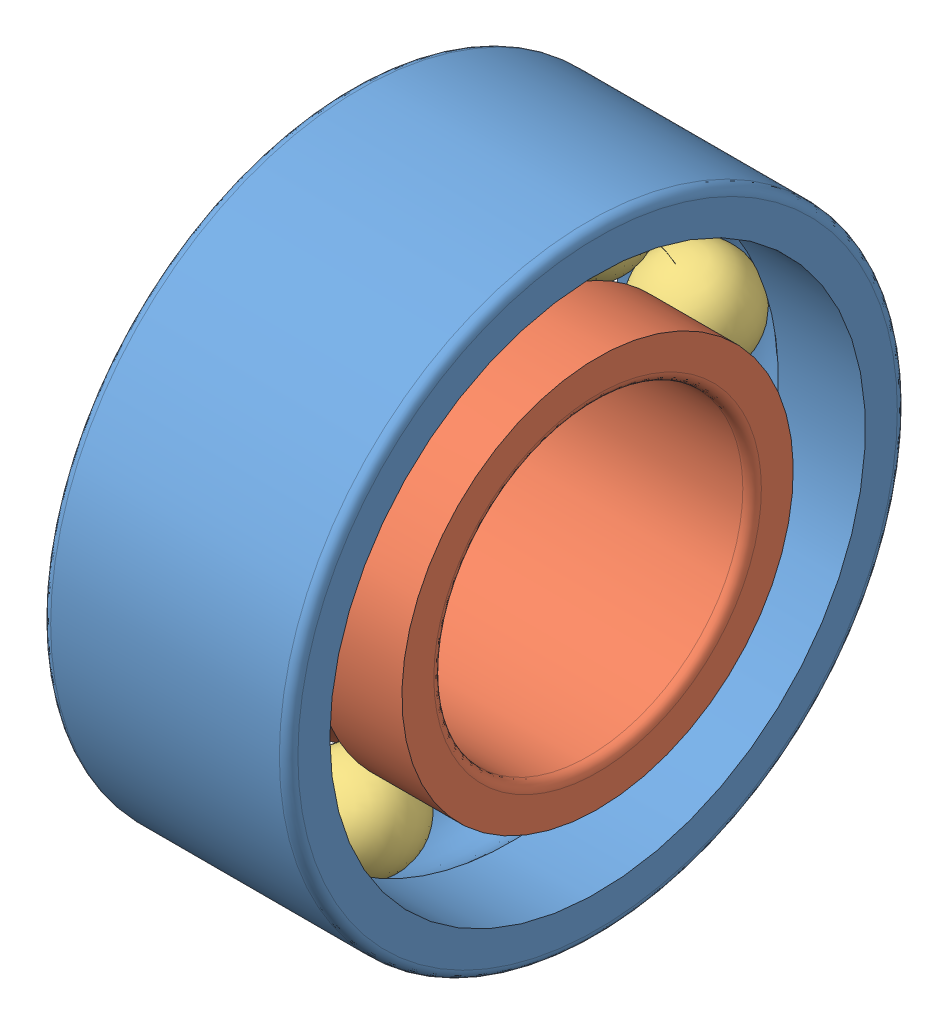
SolidWorks assembly MR105 ZZ.SLDASM, configuration Standard (file format 8000). Lengths in mm.
Overall size (4 12.48 12.48).
4 component instances, 3 part files, 7 mates.
Components (placement in the parent):
- Outer_Bearing-1: Outer_Bearing.SLDPRT [Standard] at (-2.4767 0.2733 10) size (4 10 10)
- Inner_Bearing-1: Inner_Bearing.SLDPRT [Standard] at (-2.4767 0.2733 10) x (1 0 0) z (0 0.279552 0.960131) size (4 6.33 6.33)
- bearing_mr105_1_03-1: bearing_mr105_1_03.SLDPRT [Default] at (-2.4767 0.2733 10) x (1 0 0) z (0 -0.287918 0.957655) size (1.67 9.17 9.17)
- bearing_mr105_1_03-2: bearing_mr105_1_03.SLDPRT [Default] at (-2.4767 0.2733 10) x (1 0 0) z (0 0.488197 0.872733) size (1.67 9.17 9.17)
Mates (geometry in assembly coordinates):
- Deckungsgleich1: coincident aligned: plane of Outer_Bearing-1 through (1.0282 5.1233 10) normal (1 0 0); plane of Inner_Bearing-1 through (1.0282 3.3137 9.1148) normal (1 0 0)
- Tangential1: tangent: torus of Outer_Bearing-1; sphere of bearing_mr105_1_03-1
- Tangential2: tangent: torus of Outer_Bearing-1; sphere of bearing_mr105_1_03-1
- Tangential3: tangent: torus of Inner_Bearing-1; sphere of bearing_mr105_1_03-1
- Tangential4: tangent: torus of Inner_Bearing-1; sphere of bearing_mr105_1_03-1
- Tangential5: tangent: torus of Outer_Bearing-1; sphere of bearing_mr105_1_03-2
- Tangential6: tangent: torus of Outer_Bearing-1; sphere of bearing_mr105_1_03-2
